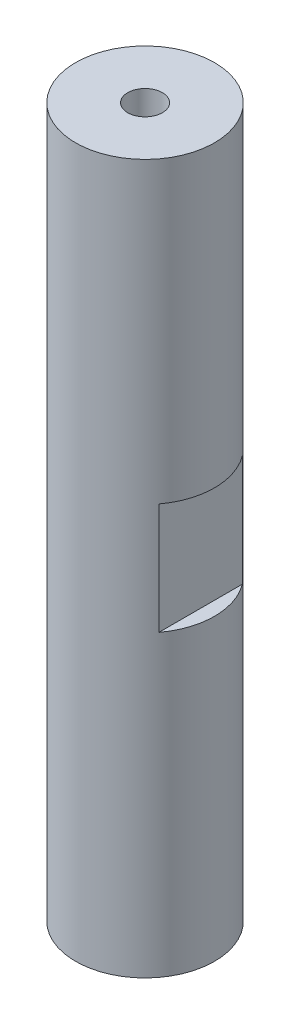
ISO-10303-21;
HEADER;
FILE_DESCRIPTION(('STEP AP214'),'2;1');
FILE_NAME('part.step','',(''),(''),'','','');
FILE_SCHEMA(('AUTOMOTIVE_DESIGN { 1 0 10303 214 1 1 1 1 }'));
ENDSEC;
DATA;
#1=APPLICATION_CONTEXT('core data for automotive mechanical design processes');
#2=APPLICATION_PROTOCOL_DEFINITION('international standard','automotive_design',2000,#1);
#3=PRODUCT_CONTEXT('',#1,'mechanical');
#4=PRODUCT('Part','Part','',(#3));
#5=PRODUCT_RELATED_PRODUCT_CATEGORY('part','',(#4));
#6=PRODUCT_DEFINITION_FORMATION('','',#4);
#7=PRODUCT_DEFINITION_CONTEXT('part definition',#1,'design');
#8=PRODUCT_DEFINITION('design','',#6,#7);
#9=PRODUCT_DEFINITION_SHAPE('','',#8);
#10=(LENGTH_UNIT() NAMED_UNIT(*) SI_UNIT(.MILLI.,.METRE.));
#11=(NAMED_UNIT(*) PLANE_ANGLE_UNIT() SI_UNIT($,.RADIAN.));
#12=(NAMED_UNIT(*) SI_UNIT($,.STERADIAN.) SOLID_ANGLE_UNIT());
#13=UNCERTAINTY_MEASURE_WITH_UNIT(LENGTH_MEASURE(1.E-05),#10,'distance_accuracy_value','');
#14=(GEOMETRIC_REPRESENTATION_CONTEXT(3) GLOBAL_UNCERTAINTY_ASSIGNED_CONTEXT((#13)) GLOBAL_UNIT_ASSIGNED_CONTEXT((#10,
#11,#12)) REPRESENTATION_CONTEXT('',''));
#15=CARTESIAN_POINT('',(0.,0.,0.));
#16=DIRECTION('',(0.,0.,1.));
#17=DIRECTION('',(1.,0.,0.));
#18=AXIS2_PLACEMENT_3D('',#15,#16,#17);
#19=CARTESIAN_POINT('',(0.,86.9999999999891,0.));
#20=DIRECTION('',(0.,1.,0.));
#21=DIRECTION('',(0.,0.,1.));
#22=AXIS2_PLACEMENT_3D('',#19,#20,#21);
#23=CONICAL_SURFACE('',#22,2.49999999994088,1.02974425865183);
#24=CARTESIAN_POINT('',(0.,85.4978484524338,2.8421709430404E-11));
#25=VERTEX_POINT('',#24);
#26=VERTEX_LOOP('',#25);
#27=FACE_BOUND('',#26,.T.);
#28=CARTESIAN_POINT('',(0.,87.,0.));
#29=DIRECTION('',(0.,1.,0.));
#30=DIRECTION('',(0.,0.,1.));
#31=AXIS2_PLACEMENT_3D('',#28,#29,#30);
#32=CIRCLE('',#31,2.5);
#33=CARTESIAN_POINT('',(0.,87.,2.5));
#34=VERTEX_POINT('',#33);
#35=EDGE_CURVE('E106',#34,#34,#32,.T.);
#36=ORIENTED_EDGE('',*,*,#35,.T.);
#37=EDGE_LOOP('',(#36));
#38=FACE_BOUND('',#37,.T.);
#39=ADVANCED_FACE('F17',(#27,#38),#23,.F.);
#40=CARTESIAN_POINT('',(0.,14.9999999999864,0.));
#41=DIRECTION('',(0.,-1.,0.));
#42=DIRECTION('',(0.,0.,-1.));
#43=AXIS2_PLACEMENT_3D('',#40,#41,#42);
#44=CONICAL_SURFACE('',#43,2.49999999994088,1.02974425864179);
#45=CARTESIAN_POINT('',(0.,16.5021515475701,0.));
#46=VERTEX_POINT('',#45);
#47=VERTEX_LOOP('',#46);
#48=FACE_BOUND('',#47,.T.);
#49=CARTESIAN_POINT('',(0.,15.,0.));
#50=DIRECTION('',(0.,-1.,0.));
#51=DIRECTION('',(0.,0.,-1.));
#52=AXIS2_PLACEMENT_3D('',#49,#50,#51);
#53=CIRCLE('',#52,2.49999999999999);
#54=CARTESIAN_POINT('',(0.,15.,-2.49999999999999));
#55=VERTEX_POINT('',#54);
#56=EDGE_CURVE('E67',#55,#55,#53,.T.);
#57=ORIENTED_EDGE('',*,*,#56,.T.);
#58=EDGE_LOOP('',(#57));
#59=FACE_BOUND('',#58,.T.);
#60=ADVANCED_FACE('F223',(#48,#59),#44,.F.);
#61=CARTESIAN_POINT('',(0.,102.,0.));
#62=DIRECTION('',(0.,1.,0.));
#63=DIRECTION('',(0.,0.,1.));
#64=AXIS2_PLACEMENT_3D('',#61,#62,#63);
#65=CYLINDRICAL_SURFACE('',#64,2.5);
#66=CARTESIAN_POINT('',(0.,102.,0.));
#67=DIRECTION('',(0.,1.,0.));
#68=DIRECTION('',(0.,0.,1.));
#69=AXIS2_PLACEMENT_3D('',#66,#67,#68);
#70=CIRCLE('',#69,2.5);
#71=CARTESIAN_POINT('',(0.,102.,2.5));
#72=VERTEX_POINT('',#71);
#73=EDGE_CURVE('E20',#72,#72,#70,.F.);
#74=ORIENTED_EDGE('',*,*,#73,.F.);
#75=EDGE_LOOP('',(#74));
#76=FACE_BOUND('',#75,.T.);
#77=ORIENTED_EDGE('',*,*,#35,.F.);
#78=EDGE_LOOP('',(#77));
#79=FACE_BOUND('',#78,.T.);
#80=ADVANCED_FACE('F213',(#76,#79),#65,.F.);
#81=CARTESIAN_POINT('',(0.,0.,0.));
#82=DIRECTION('',(0.,-1.,0.));
#83=DIRECTION('',(0.,0.,-1.));
#84=AXIS2_PLACEMENT_3D('',#81,#82,#83);
#85=CYLINDRICAL_SURFACE('',#84,2.49999999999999);
#86=ORIENTED_EDGE('',*,*,#56,.F.);
#87=EDGE_LOOP('',(#86));
#88=FACE_BOUND('',#87,.T.);
#89=CARTESIAN_POINT('',(0.,0.,0.));
#90=DIRECTION('',(0.,-1.,0.));
#91=DIRECTION('',(0.,0.,-1.));
#92=AXIS2_PLACEMENT_3D('',#89,#90,#91);
#93=CIRCLE('',#92,2.49999999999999);
#94=CARTESIAN_POINT('',(0.,0.,-2.49999999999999));
#95=VERTEX_POINT('',#94);
#96=EDGE_CURVE('E81',#95,#95,#93,.T.);
#97=ORIENTED_EDGE('',*,*,#96,.T.);
#98=EDGE_LOOP('',(#97));
#99=FACE_BOUND('',#98,.T.);
#100=ADVANCED_FACE('F204',(#88,#99),#85,.F.);
#101=CARTESIAN_POINT('',(-12.,43.,-10.));
#102=DIRECTION('',(0.,-1.,0.));
#103=DIRECTION('',(0.,0.,-1.));
#104=AXIS2_PLACEMENT_3D('',#101,#102,#103);
#105=PLANE('',#104);
#106=CARTESIAN_POINT('',(0.,43.,0.));
#107=DIRECTION('',(0.,-1.,0.));
#108=DIRECTION('',(0.,0.,-1.));
#109=AXIS2_PLACEMENT_3D('',#106,#107,#108);
#110=CIRCLE('',#109,10.);
#111=CARTESIAN_POINT('',(-7.99999999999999,43.,6.00000000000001));
#112=VERTEX_POINT('',#111);
#113=CARTESIAN_POINT('',(-8.,43.,-6.00000000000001));
#114=VERTEX_POINT('',#113);
#115=EDGE_CURVE('E64',#112,#114,#110,.T.);
#116=ORIENTED_EDGE('',*,*,#115,.F.);
#117=DIRECTION('',(0.,0.,-1.));
#118=VECTOR('',#117,1.);
#119=CARTESIAN_POINT('',(-7.99999999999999,43.,-10.));
#120=LINE('',#119,#118);
#121=EDGE_CURVE('E59',#112,#114,#120,.T.);
#122=ORIENTED_EDGE('',*,*,#121,.T.);
#123=EDGE_LOOP('',(#116,#122));
#124=FACE_BOUND('',#123,.T.);
#125=ADVANCED_FACE('F62',(#124),#105,.F.);
#126=CARTESIAN_POINT('',(-7.99999999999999,43.,-10.));
#127=DIRECTION('',(1.,0.,0.));
#128=DIRECTION('',(0.,0.,-1.));
#129=AXIS2_PLACEMENT_3D('',#126,#127,#128);
#130=PLANE('',#129);
#131=DIRECTION('',(0.,-1.,0.));
#132=VECTOR('',#131,1.);
#133=CARTESIAN_POINT('',(-8.,102.,-6.));
#134=LINE('',#133,#132);
#135=CARTESIAN_POINT('',(-8.,59.,-6.00000000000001));
#136=VERTEX_POINT('',#135);
#137=EDGE_CURVE('E70',#114,#136,#134,.F.);
#138=ORIENTED_EDGE('',*,*,#137,.F.);
#139=ORIENTED_EDGE('',*,*,#121,.F.);
#140=DIRECTION('',(0.,-1.,0.));
#141=VECTOR('',#140,1.);
#142=CARTESIAN_POINT('',(-7.99999999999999,102.,6.00000000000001));
#143=LINE('',#142,#141);
#144=CARTESIAN_POINT('',(-7.99999999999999,59.,6.00000000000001));
#145=VERTEX_POINT('',#144);
#146=EDGE_CURVE('E79',#145,#112,#143,.T.);
#147=ORIENTED_EDGE('',*,*,#146,.F.);
#148=DIRECTION('',(0.,0.,1.));
#149=VECTOR('',#148,1.);
#150=CARTESIAN_POINT('',(-7.99999999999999,59.,-10.));
#151=LINE('',#150,#149);
#152=EDGE_CURVE('E66',#145,#136,#151,.F.);
#153=ORIENTED_EDGE('',*,*,#152,.T.);
#154=EDGE_LOOP('',(#138,#139,#147,#153));
#155=FACE_BOUND('',#154,.T.);
#156=ADVANCED_FACE('F71',(#155),#130,.F.);
#157=CARTESIAN_POINT('',(-12.,59.,-10.));
#158=DIRECTION('',(0.,1.,0.));
#159=DIRECTION('',(0.,0.,1.));
#160=AXIS2_PLACEMENT_3D('',#157,#158,#159);
#161=PLANE('',#160);
#162=CARTESIAN_POINT('',(0.,59.,0.));
#163=DIRECTION('',(0.,-1.,0.));
#164=DIRECTION('',(0.,0.,-1.));
#165=AXIS2_PLACEMENT_3D('',#162,#163,#164);
#166=CIRCLE('',#165,10.);
#167=EDGE_CURVE('E76',#136,#145,#166,.F.);
#168=ORIENTED_EDGE('',*,*,#167,.F.);
#169=ORIENTED_EDGE('',*,*,#152,.F.);
#170=EDGE_LOOP('',(#168,#169));
#171=FACE_BOUND('',#170,.T.);
#172=ADVANCED_FACE('F129',(#171),#161,.F.);
#173=CARTESIAN_POINT('',(8.,43.,-10.));
#174=DIRECTION('',(0.,-1.,0.));
#175=DIRECTION('',(0.,0.,-1.));
#176=AXIS2_PLACEMENT_3D('',#173,#174,#175);
#177=PLANE('',#176);
#178=CARTESIAN_POINT('',(0.,43.,0.));
#179=DIRECTION('',(0.,-1.,0.));
#180=DIRECTION('',(0.,0.,-1.));
#181=AXIS2_PLACEMENT_3D('',#178,#179,#180);
#182=CIRCLE('',#181,10.);
#183=CARTESIAN_POINT('',(8.,43.,-6.));
#184=VERTEX_POINT('',#183);
#185=CARTESIAN_POINT('',(8.,43.,6.));
#186=VERTEX_POINT('',#185);
#187=EDGE_CURVE('E99',#184,#186,#182,.T.);
#188=ORIENTED_EDGE('',*,*,#187,.F.);
#189=DIRECTION('',(0.,0.,1.));
#190=VECTOR('',#189,1.);
#191=CARTESIAN_POINT('',(8.,43.,-10.));
#192=LINE('',#191,#190);
#193=EDGE_CURVE('E91',#184,#186,#192,.T.);
#194=ORIENTED_EDGE('',*,*,#193,.T.);
#195=EDGE_LOOP('',(#188,#194));
#196=FACE_BOUND('',#195,.T.);
#197=ADVANCED_FACE('F116',(#196),#177,.F.);
#198=CARTESIAN_POINT('',(8.,43.,-10.));
#199=DIRECTION('',(-1.,0.,0.));
#200=DIRECTION('',(0.,0.,1.));
#201=AXIS2_PLACEMENT_3D('',#198,#199,#200);
#202=PLANE('',#201);
#203=DIRECTION('',(0.,-1.,0.));
#204=VECTOR('',#203,1.);
#205=CARTESIAN_POINT('',(8.,102.,6.));
#206=LINE('',#205,#204);
#207=CARTESIAN_POINT('',(8.,59.,6.));
#208=VERTEX_POINT('',#207);
#209=EDGE_CURVE('E95',#186,#208,#206,.F.);
#210=ORIENTED_EDGE('',*,*,#209,.F.);
#211=ORIENTED_EDGE('',*,*,#193,.F.);
#212=DIRECTION('',(0.,-1.,0.));
#213=VECTOR('',#212,1.);
#214=CARTESIAN_POINT('',(8.,102.,-6.));
#215=LINE('',#214,#213);
#216=CARTESIAN_POINT('',(8.,59.,-6.));
#217=VERTEX_POINT('',#216);
#218=EDGE_CURVE('E100',#217,#184,#215,.T.);
#219=ORIENTED_EDGE('',*,*,#218,.F.);
#220=DIRECTION('',(0.,0.,1.));
#221=VECTOR('',#220,1.);
#222=CARTESIAN_POINT('',(8.,59.,-10.));
#223=LINE('',#222,#221);
#224=EDGE_CURVE('E35',#217,#208,#223,.T.);
#225=ORIENTED_EDGE('',*,*,#224,.T.);
#226=EDGE_LOOP('',(#210,#211,#219,#225));
#227=FACE_BOUND('',#226,.T.);
#228=ADVANCED_FACE('F117',(#227),#202,.F.);
#229=CARTESIAN_POINT('',(8.,59.,-10.));
#230=DIRECTION('',(0.,1.,0.));
#231=DIRECTION('',(0.,0.,1.));
#232=AXIS2_PLACEMENT_3D('',#229,#230,#231);
#233=PLANE('',#232);
#234=CARTESIAN_POINT('',(0.,59.,0.));
#235=DIRECTION('',(0.,-1.,0.));
#236=DIRECTION('',(0.,0.,-1.));
#237=AXIS2_PLACEMENT_3D('',#234,#235,#236);
#238=CIRCLE('',#237,10.);
#239=EDGE_CURVE('E98',#208,#217,#238,.F.);
#240=ORIENTED_EDGE('',*,*,#239,.F.);
#241=ORIENTED_EDGE('',*,*,#224,.F.);
#242=EDGE_LOOP('',(#240,#241));
#243=FACE_BOUND('',#242,.T.);
#244=ADVANCED_FACE('F119',(#243),#233,.F.);
#245=CARTESIAN_POINT('',(0.,102.,0.));
#246=DIRECTION('',(0.,1.,0.));
#247=DIRECTION('',(0.,0.,1.));
#248=AXIS2_PLACEMENT_3D('',#245,#246,#247);
#249=PLANE('',#248);
#250=CARTESIAN_POINT('',(0.,102.,0.));
#251=DIRECTION('',(0.,-1.,0.));
#252=DIRECTION('',(0.,0.,-1.));
#253=AXIS2_PLACEMENT_3D('',#250,#251,#252);
#254=CIRCLE('',#253,10.);
#255=CARTESIAN_POINT('',(0.,102.,-10.));
#256=VERTEX_POINT('',#255);
#257=EDGE_CURVE('E26',#256,#256,#254,.T.);
#258=ORIENTED_EDGE('',*,*,#257,.F.);
#259=EDGE_LOOP('',(#258));
#260=FACE_BOUND('',#259,.T.);
#261=ORIENTED_EDGE('',*,*,#73,.T.);
#262=EDGE_LOOP('',(#261));
#263=FACE_BOUND('',#262,.T.);
#264=ADVANCED_FACE('F126',(#260,#263),#249,.T.);
#265=CARTESIAN_POINT('',(0.,0.,0.));
#266=DIRECTION('',(0.,1.,0.));
#267=DIRECTION('',(0.,0.,1.));
#268=AXIS2_PLACEMENT_3D('',#265,#266,#267);
#269=PLANE('',#268);
#270=CARTESIAN_POINT('',(0.,0.,0.));
#271=DIRECTION('',(0.,-1.,0.));
#272=DIRECTION('',(0.,0.,-1.));
#273=AXIS2_PLACEMENT_3D('',#270,#271,#272);
#274=CIRCLE('',#273,10.);
#275=CARTESIAN_POINT('',(0.,0.,-10.));
#276=VERTEX_POINT('',#275);
#277=EDGE_CURVE('E11',#276,#276,#274,.F.);
#278=ORIENTED_EDGE('',*,*,#277,.F.);
#279=EDGE_LOOP('',(#278));
#280=FACE_BOUND('',#279,.T.);
#281=ORIENTED_EDGE('',*,*,#96,.F.);
#282=EDGE_LOOP('',(#281));
#283=FACE_BOUND('',#282,.T.);
#284=ADVANCED_FACE('F132',(#280,#283),#269,.F.);
#285=CARTESIAN_POINT('',(0.,102.,0.));
#286=DIRECTION('',(0.,-1.,0.));
#287=DIRECTION('',(0.,0.,-1.));
#288=AXIS2_PLACEMENT_3D('',#285,#286,#287);
#289=CYLINDRICAL_SURFACE('',#288,10.);
#290=ORIENTED_EDGE('',*,*,#277,.T.);
#291=EDGE_LOOP('',(#290));
#292=FACE_BOUND('',#291,.T.);
#293=ORIENTED_EDGE('',*,*,#257,.T.);
#294=EDGE_LOOP('',(#293));
#295=FACE_BOUND('',#294,.T.);
#296=ORIENTED_EDGE('',*,*,#209,.T.);
#297=ORIENTED_EDGE('',*,*,#239,.T.);
#298=ORIENTED_EDGE('',*,*,#218,.T.);
#299=ORIENTED_EDGE('',*,*,#187,.T.);
#300=EDGE_LOOP('',(#296,#297,#298,#299));
#301=FACE_BOUND('',#300,.T.);
#302=ORIENTED_EDGE('',*,*,#137,.T.);
#303=ORIENTED_EDGE('',*,*,#167,.T.);
#304=ORIENTED_EDGE('',*,*,#146,.T.);
#305=ORIENTED_EDGE('',*,*,#115,.T.);
#306=EDGE_LOOP('',(#302,#303,#304,#305));
#307=FACE_BOUND('',#306,.T.);
#308=ADVANCED_FACE('F78',(#292,#295,#301,#307),#289,.T.);
#309=CLOSED_SHELL('',(#39,#60,#80,#100,#125,#156,#172,#197,#228,#244,#264,#284,#308));
#310=MANIFOLD_SOLID_BREP('B1',#309);
#311=ADVANCED_BREP_SHAPE_REPRESENTATION('',(#18,#310),#14);
#312=SHAPE_DEFINITION_REPRESENTATION(#9,#311);
ENDSEC;
END-ISO-10303-21;
